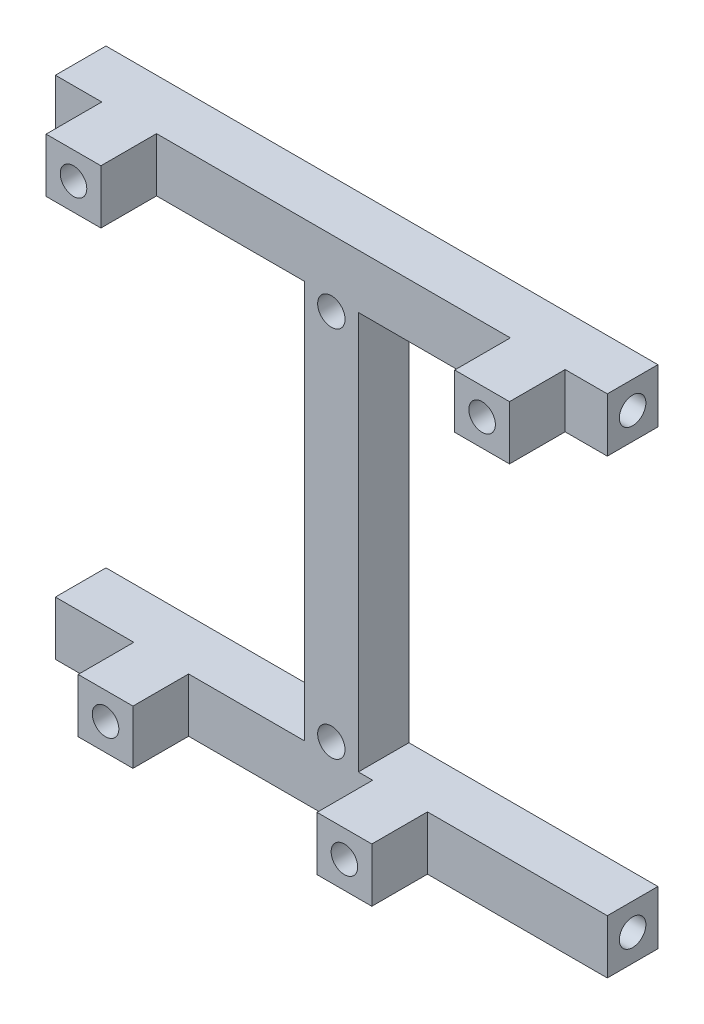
from build123d import *

# Parameters (mm, degrees)
BOSS_EXTRUDE2_DEPTH = 6
SKETCH2_W           = 6.5
SKETCH2_H           = 6.4
BOSS_EXTRUDE3_DEPTH = 6.6
CUT_EXTRUDE1_DEPTH  = 5
CUT_EXTRUDE2_DEPTH  = 51.219845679
CUT_EXTRUDE3_DEPTH  = 15
CUT_EXTRUDE4_START  = -15
CUT_EXTRUDE4_DEPTH  = 15
SKETCH7_W           = 6
SKETCH7_H           = 60
CUT_EXTRUDE5_DEPTH  = 7
SKETCH8_W           = 6
SKETCH8_H           = 60
CUT_EXTRUDE6_DEPTH  = 7


with BuildPart() as part:
    # Sketch1 → Boss-Extrude2 (new body)
    with BuildSketch(Plane.XY):
        Polygon((-39.73, -30), (39.73, -30), (39.73, -23.6), (3.2, -23.6), (3.2, 23.6), (39.73, 23.6), (39.73, 30), (-39.73, 30), (-39.73, 23.6), (-3.2, 23.6), (-3.2, -23.6), (-39.73, -23.6), align=None)
    extrude(amount=BOSS_EXTRUDE2_DEPTH)

    # Sketch2 → Boss-Extrude3 (add)
    with BuildSketch(Plane.XY.offset(6)):
        with Locations((24.48, 26.8)):
            Rectangle(SKETCH2_W, SKETCH2_H)
        with Locations((-23.98, 26.8)):
            Rectangle(SKETCH2_W, SKETCH2_H)
        with Locations((-20.18, -26.8)):
            Rectangle(SKETCH2_W, SKETCH2_H)
        with Locations((8.15, -26.8)):
            Rectangle(SKETCH2_W, SKETCH2_H)
    extrude(amount=BOSS_EXTRUDE3_DEPTH)

    # Sketch3 → Cut-Extrude1 (cut)
    with BuildSketch(Plane.XY.offset(12.6)):
        with BuildLine():
            ThreePointArc((-19.057707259, -25.694973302), (-20.18, -25.225), (-21.302292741, -25.694973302))
            Line((-21.302292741, -25.694973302), (-20.18, -26.8))
            Line((-20.18, -26.8), (-19.057707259, -25.694973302))
        make_face()
        with BuildLine():
            Line((-20.18, -26.8), (-21.302292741, -25.694973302))
            ThreePointArc((-21.302292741, -25.694973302), (-21.755, -26.8), (-21.302292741, -27.905026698))
            Line((-21.302292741, -27.905026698), (-20.18, -26.8))
        make_face()
        with BuildLine():
            Line((-19.057707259, -25.694973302), (-20.18, -26.8))
            Line((-20.18, -26.8), (-19.057707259, -27.905026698))
            ThreePointArc((-19.057707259, -27.905026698), (-18.72256457, -27.397082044), (-18.605, -26.8))
            ThreePointArc((-18.605, -26.8), (-18.72256457, -26.202917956), (-19.057707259, -25.694973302))
        make_face()
        with BuildLine():
            Line((-19.057707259, -27.905026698), (-20.18, -26.8))
            Line((-20.18, -26.8), (-21.302292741, -27.905026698))
            ThreePointArc((-21.302292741, -27.905026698), (-20.18, -28.375), (-19.057707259, -27.905026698))
        make_face()
        with BuildLine():
            ThreePointArc((-19.057707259, -25.694973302), (-20.18, -25.225), (-21.302292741, -25.694973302))
            Line((-21.302292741, -25.694973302), (-20.18, -26.8))
            Line((-20.18, -26.8), (-19.057707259, -25.694973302))
        make_face()
        with BuildLine():
            Line((-20.18, -26.8), (-21.302292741, -25.694973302))
            ThreePointArc((-21.302292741, -25.694973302), (-21.755, -26.8), (-21.302292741, -27.905026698))
            Line((-21.302292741, -27.905026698), (-20.18, -26.8))
        make_face()
        with BuildLine():
            Line((-19.057707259, -25.694973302), (-20.18, -26.8))
            Line((-20.18, -26.8), (-19.057707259, -27.905026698))
            ThreePointArc((-19.057707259, -27.905026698), (-18.72256457, -27.397082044), (-18.605, -26.8))
            ThreePointArc((-18.605, -26.8), (-18.72256457, -26.202917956), (-19.057707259, -25.694973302))
        make_face()
        with BuildLine():
            Line((-19.057707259, -27.905026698), (-20.18, -26.8))
            Line((-20.18, -26.8), (-21.302292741, -27.905026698))
            ThreePointArc((-21.302292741, -27.905026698), (-20.18, -28.375), (-19.057707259, -27.905026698))
        make_face()
        with BuildLine():
            ThreePointArc((-19.057707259, -25.694973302), (-20.18, -25.225), (-21.302292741, -25.694973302))
            Line((-21.302292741, -25.694973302), (-20.18, -26.8))
            Line((-20.18, -26.8), (-19.057707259, -25.694973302))
        make_face()
        with BuildLine():
            Line((-20.18, -26.8), (-21.302292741, -25.694973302))
            ThreePointArc((-21.302292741, -25.694973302), (-21.755, -26.8), (-21.302292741, -27.905026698))
            Line((-21.302292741, -27.905026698), (-20.18, -26.8))
        make_face()
        with BuildLine():
            Line((-19.057707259, -25.694973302), (-20.18, -26.8))
            Line((-20.18, -26.8), (-19.057707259, -27.905026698))
            ThreePointArc((-19.057707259, -27.905026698), (-18.72256457, -27.397082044), (-18.605, -26.8))
            ThreePointArc((-18.605, -26.8), (-18.72256457, -26.202917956), (-19.057707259, -25.694973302))
        make_face()
        with BuildLine():
            Line((-19.057707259, -27.905026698), (-20.18, -26.8))
            Line((-20.18, -26.8), (-21.302292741, -27.905026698))
            ThreePointArc((-21.302292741, -27.905026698), (-20.18, -28.375), (-19.057707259, -27.905026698))
        make_face()
        with BuildLine():
            ThreePointArc((-19.057707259, -25.694973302), (-20.18, -25.225), (-21.302292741, -25.694973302))
            Line((-21.302292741, -25.694973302), (-20.18, -26.8))
            Line((-20.18, -26.8), (-19.057707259, -25.694973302))
        make_face()
        with BuildLine():
            Line((-20.18, -26.8), (-21.302292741, -25.694973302))
            ThreePointArc((-21.302292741, -25.694973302), (-21.755, -26.8), (-21.302292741, -27.905026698))
            Line((-21.302292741, -27.905026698), (-20.18, -26.8))
        make_face()
        with BuildLine():
            Line((-19.057707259, -25.694973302), (-20.18, -26.8))
            Line((-20.18, -26.8), (-19.057707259, -27.905026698))
            ThreePointArc((-19.057707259, -27.905026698), (-18.72256457, -27.397082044), (-18.605, -26.8))
            ThreePointArc((-18.605, -26.8), (-18.72256457, -26.202917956), (-19.057707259, -25.694973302))
        make_face()
        with BuildLine():
            Line((-19.057707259, -27.905026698), (-20.18, -26.8))
            Line((-20.18, -26.8), (-21.302292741, -27.905026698))
            ThreePointArc((-21.302292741, -27.905026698), (-20.18, -28.375), (-19.057707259, -27.905026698))
        make_face()
        with BuildLine():
            ThreePointArc((9.272292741, -25.694973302), (8.15, -25.225), (7.027707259, -25.694973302))
            Line((7.027707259, -25.694973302), (8.15, -26.8))
            Line((8.15, -26.8), (9.272292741, -25.694973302))
        make_face()
        with BuildLine():
            Line((8.15, -26.8), (7.027707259, -25.694973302))
            ThreePointArc((7.027707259, -25.694973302), (6.575, -26.8), (7.027707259, -27.905026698))
            Line((7.027707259, -27.905026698), (8.15, -26.8))
        make_face()
        with BuildLine():
            Line((9.272292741, -25.694973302), (8.15, -26.8))
            Line((8.15, -26.8), (9.272292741, -27.905026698))
            ThreePointArc((9.272292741, -27.905026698), (9.60743543, -27.397082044), (9.725, -26.8))
            ThreePointArc((9.725, -26.8), (9.60743543, -26.202917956), (9.272292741, -25.694973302))
        make_face()
        with BuildLine():
            Line((9.272292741, -27.905026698), (8.15, -26.8))
            Line((8.15, -26.8), (7.027707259, -27.905026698))
            ThreePointArc((7.027707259, -27.905026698), (8.15, -28.375), (9.272292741, -27.905026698))
        make_face()
        with BuildLine():
            ThreePointArc((9.272292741, -25.694973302), (8.15, -25.225), (7.027707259, -25.694973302))
            Line((7.027707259, -25.694973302), (8.15, -26.8))
            Line((8.15, -26.8), (9.272292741, -25.694973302))
        make_face()
        with BuildLine():
            Line((8.15, -26.8), (7.027707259, -25.694973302))
            ThreePointArc((7.027707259, -25.694973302), (6.575, -26.8), (7.027707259, -27.905026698))
            Line((7.027707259, -27.905026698), (8.15, -26.8))
        make_face()
        with BuildLine():
            Line((9.272292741, -25.694973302), (8.15, -26.8))
            Line((8.15, -26.8), (9.272292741, -27.905026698))
            ThreePointArc((9.272292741, -27.905026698), (9.60743543, -27.397082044), (9.725, -26.8))
            ThreePointArc((9.725, -26.8), (9.60743543, -26.202917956), (9.272292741, -25.694973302))
        make_face()
        with BuildLine():
            Line((9.272292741, -27.905026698), (8.15, -26.8))
            Line((8.15, -26.8), (7.027707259, -27.905026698))
            ThreePointArc((7.027707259, -27.905026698), (8.15, -28.375), (9.272292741, -27.905026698))
        make_face()
        with BuildLine():
            ThreePointArc((9.272292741, -25.694973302), (8.15, -25.225), (7.027707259, -25.694973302))
            Line((7.027707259, -25.694973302), (8.15, -26.8))
            Line((8.15, -26.8), (9.272292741, -25.694973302))
        make_face()
        with BuildLine():
            Line((8.15, -26.8), (7.027707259, -25.694973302))
            ThreePointArc((7.027707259, -25.694973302), (6.575, -26.8), (7.027707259, -27.905026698))
            Line((7.027707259, -27.905026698), (8.15, -26.8))
        make_face()
        with BuildLine():
            Line((9.272292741, -25.694973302), (8.15, -26.8))
            Line((8.15, -26.8), (9.272292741, -27.905026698))
            ThreePointArc((9.272292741, -27.905026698), (9.60743543, -27.397082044), (9.725, -26.8))
            ThreePointArc((9.725, -26.8), (9.60743543, -26.202917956), (9.272292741, -25.694973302))
        make_face()
        with BuildLine():
            Line((9.272292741, -27.905026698), (8.15, -26.8))
            Line((8.15, -26.8), (7.027707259, -27.905026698))
            ThreePointArc((7.027707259, -27.905026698), (8.15, -28.375), (9.272292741, -27.905026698))
        make_face()
        with BuildLine():
            ThreePointArc((9.272292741, -25.694973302), (8.15, -25.225), (7.027707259, -25.694973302))
            Line((7.027707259, -25.694973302), (8.15, -26.8))
            Line((8.15, -26.8), (9.272292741, -25.694973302))
        make_face()
        with BuildLine():
            Line((8.15, -26.8), (7.027707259, -25.694973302))
            ThreePointArc((7.027707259, -25.694973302), (6.575, -26.8), (7.027707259, -27.905026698))
            Line((7.027707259, -27.905026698), (8.15, -26.8))
        make_face()
        with BuildLine():
            Line((9.272292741, -25.694973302), (8.15, -26.8))
            Line((8.15, -26.8), (9.272292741, -27.905026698))
            ThreePointArc((9.272292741, -27.905026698), (9.60743543, -27.397082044), (9.725, -26.8))
            ThreePointArc((9.725, -26.8), (9.60743543, -26.202917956), (9.272292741, -25.694973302))
        make_face()
        with BuildLine():
            Line((9.272292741, -27.905026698), (8.15, -26.8))
            Line((8.15, -26.8), (7.027707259, -27.905026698))
            ThreePointArc((7.027707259, -27.905026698), (8.15, -28.375), (9.272292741, -27.905026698))
        make_face()
        with BuildLine():
            ThreePointArc((-22.857707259, 27.905026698), (-23.98, 28.375), (-25.102292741, 27.905026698))
            Line((-25.102292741, 27.905026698), (-23.98, 26.8))
            Line((-23.98, 26.8), (-22.857707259, 27.905026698))
        make_face()
        with BuildLine():
            Line((-23.98, 26.8), (-25.102292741, 27.905026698))
            ThreePointArc((-25.102292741, 27.905026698), (-25.555, 26.8), (-25.102292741, 25.694973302))
            Line((-25.102292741, 25.694973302), (-23.98, 26.8))
        make_face()
        with BuildLine():
            Line((-22.857707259, 27.905026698), (-23.98, 26.8))
            Line((-23.98, 26.8), (-22.857707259, 25.694973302))
            ThreePointArc((-22.857707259, 25.694973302), (-22.52256457, 26.202917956), (-22.405, 26.8))
            ThreePointArc((-22.405, 26.8), (-22.52256457, 27.397082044), (-22.857707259, 27.905026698))
        make_face()
        with BuildLine():
            Line((-22.857707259, 25.694973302), (-23.98, 26.8))
            Line((-23.98, 26.8), (-25.102292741, 25.694973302))
            ThreePointArc((-25.102292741, 25.694973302), (-23.98, 25.225), (-22.857707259, 25.694973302))
        make_face()
        with BuildLine():
            ThreePointArc((-22.857707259, 27.905026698), (-23.98, 28.375), (-25.102292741, 27.905026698))
            Line((-25.102292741, 27.905026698), (-23.98, 26.8))
            Line((-23.98, 26.8), (-22.857707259, 27.905026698))
        make_face()
        with BuildLine():
            Line((-23.98, 26.8), (-25.102292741, 27.905026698))
            ThreePointArc((-25.102292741, 27.905026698), (-25.555, 26.8), (-25.102292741, 25.694973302))
            Line((-25.102292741, 25.694973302), (-23.98, 26.8))
        make_face()
        with BuildLine():
            Line((-22.857707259, 27.905026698), (-23.98, 26.8))
            Line((-23.98, 26.8), (-22.857707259, 25.694973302))
            ThreePointArc((-22.857707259, 25.694973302), (-22.52256457, 26.202917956), (-22.405, 26.8))
            ThreePointArc((-22.405, 26.8), (-22.52256457, 27.397082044), (-22.857707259, 27.905026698))
        make_face()
        with BuildLine():
            Line((-22.857707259, 25.694973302), (-23.98, 26.8))
            Line((-23.98, 26.8), (-25.102292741, 25.694973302))
            ThreePointArc((-25.102292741, 25.694973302), (-23.98, 25.225), (-22.857707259, 25.694973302))
        make_face()
        with BuildLine():
            ThreePointArc((-22.857707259, 27.905026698), (-23.98, 28.375), (-25.102292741, 27.905026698))
            Line((-25.102292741, 27.905026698), (-23.98, 26.8))
            Line((-23.98, 26.8), (-22.857707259, 27.905026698))
        make_face()
        with BuildLine():
            Line((-23.98, 26.8), (-25.102292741, 27.905026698))
            ThreePointArc((-25.102292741, 27.905026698), (-25.555, 26.8), (-25.102292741, 25.694973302))
            Line((-25.102292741, 25.694973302), (-23.98, 26.8))
        make_face()
        with BuildLine():
            Line((-22.857707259, 27.905026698), (-23.98, 26.8))
            Line((-23.98, 26.8), (-22.857707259, 25.694973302))
            ThreePointArc((-22.857707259, 25.694973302), (-22.52256457, 26.202917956), (-22.405, 26.8))
            ThreePointArc((-22.405, 26.8), (-22.52256457, 27.397082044), (-22.857707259, 27.905026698))
        make_face()
        with BuildLine():
            Line((-22.857707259, 25.694973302), (-23.98, 26.8))
            Line((-23.98, 26.8), (-25.102292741, 25.694973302))
            ThreePointArc((-25.102292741, 25.694973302), (-23.98, 25.225), (-22.857707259, 25.694973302))
        make_face()
        with BuildLine():
            ThreePointArc((-22.857707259, 27.905026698), (-23.98, 28.375), (-25.102292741, 27.905026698))
            Line((-25.102292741, 27.905026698), (-23.98, 26.8))
            Line((-23.98, 26.8), (-22.857707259, 27.905026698))
        make_face()
        with BuildLine():
            Line((-23.98, 26.8), (-25.102292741, 27.905026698))
            ThreePointArc((-25.102292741, 27.905026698), (-25.555, 26.8), (-25.102292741, 25.694973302))
            Line((-25.102292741, 25.694973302), (-23.98, 26.8))
        make_face()
        with BuildLine():
            Line((-22.857707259, 27.905026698), (-23.98, 26.8))
            Line((-23.98, 26.8), (-22.857707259, 25.694973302))
            ThreePointArc((-22.857707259, 25.694973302), (-22.52256457, 26.202917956), (-22.405, 26.8))
            ThreePointArc((-22.405, 26.8), (-22.52256457, 27.397082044), (-22.857707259, 27.905026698))
        make_face()
        with BuildLine():
            Line((-22.857707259, 25.694973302), (-23.98, 26.8))
            Line((-23.98, 26.8), (-25.102292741, 25.694973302))
            ThreePointArc((-25.102292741, 25.694973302), (-23.98, 25.225), (-22.857707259, 25.694973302))
        make_face()
        with BuildLine():
            ThreePointArc((23.357707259, 27.905026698), (22.905, 26.8), (23.357707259, 25.694973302))
            Line((23.357707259, 25.694973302), (24.48, 26.8))
            Line((24.48, 26.8), (23.357707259, 27.905026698))
        make_face()
        with BuildLine():
            Line((24.48, 26.8), (23.357707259, 25.694973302))
            ThreePointArc((23.357707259, 25.694973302), (24.48, 25.225), (25.602292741, 25.694973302))
            Line((25.602292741, 25.694973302), (24.48, 26.8))
        make_face()
        with BuildLine():
            Line((23.357707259, 27.905026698), (24.48, 26.8))
            Line((24.48, 26.8), (25.602292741, 27.905026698))
            ThreePointArc((25.602292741, 27.905026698), (24.48, 28.375), (23.357707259, 27.905026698))
        make_face()
        with BuildLine():
            Line((25.602292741, 27.905026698), (24.48, 26.8))
            Line((24.48, 26.8), (25.602292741, 25.694973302))
            ThreePointArc((25.602292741, 25.694973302), (25.93743543, 26.202917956), (26.055, 26.8))
            ThreePointArc((26.055, 26.8), (25.93743543, 27.397082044), (25.602292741, 27.905026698))
        make_face()
        with BuildLine():
            ThreePointArc((23.357707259, 27.905026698), (22.905, 26.8), (23.357707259, 25.694973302))
            Line((23.357707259, 25.694973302), (24.48, 26.8))
            Line((24.48, 26.8), (23.357707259, 27.905026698))
        make_face()
        with BuildLine():
            Line((24.48, 26.8), (23.357707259, 25.694973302))
            ThreePointArc((23.357707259, 25.694973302), (24.48, 25.225), (25.602292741, 25.694973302))
            Line((25.602292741, 25.694973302), (24.48, 26.8))
        make_face()
        with BuildLine():
            Line((23.357707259, 27.905026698), (24.48, 26.8))
            Line((24.48, 26.8), (25.602292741, 27.905026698))
            ThreePointArc((25.602292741, 27.905026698), (24.48, 28.375), (23.357707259, 27.905026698))
        make_face()
        with BuildLine():
            Line((25.602292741, 27.905026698), (24.48, 26.8))
            Line((24.48, 26.8), (25.602292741, 25.694973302))
            ThreePointArc((25.602292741, 25.694973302), (25.93743543, 26.202917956), (26.055, 26.8))
            ThreePointArc((26.055, 26.8), (25.93743543, 27.397082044), (25.602292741, 27.905026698))
        make_face()
        with BuildLine():
            ThreePointArc((23.357707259, 27.905026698), (22.905, 26.8), (23.357707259, 25.694973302))
            Line((23.357707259, 25.694973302), (24.48, 26.8))
            Line((24.48, 26.8), (23.357707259, 27.905026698))
        make_face()
        with BuildLine():
            Line((24.48, 26.8), (23.357707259, 25.694973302))
            ThreePointArc((23.357707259, 25.694973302), (24.48, 25.225), (25.602292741, 25.694973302))
            Line((25.602292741, 25.694973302), (24.48, 26.8))
        make_face()
        with BuildLine():
            Line((23.357707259, 27.905026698), (24.48, 26.8))
            Line((24.48, 26.8), (25.602292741, 27.905026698))
            ThreePointArc((25.602292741, 27.905026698), (24.48, 28.375), (23.357707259, 27.905026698))
        make_face()
        with BuildLine():
            Line((25.602292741, 27.905026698), (24.48, 26.8))
            Line((24.48, 26.8), (25.602292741, 25.694973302))
            ThreePointArc((25.602292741, 25.694973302), (25.93743543, 26.202917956), (26.055, 26.8))
            ThreePointArc((26.055, 26.8), (25.93743543, 27.397082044), (25.602292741, 27.905026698))
        make_face()
        with BuildLine():
            ThreePointArc((23.357707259, 27.905026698), (22.905, 26.8), (23.357707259, 25.694973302))
            Line((23.357707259, 25.694973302), (24.48, 26.8))
            Line((24.48, 26.8), (23.357707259, 27.905026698))
        make_face()
        with BuildLine():
            Line((24.48, 26.8), (23.357707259, 25.694973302))
            ThreePointArc((23.357707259, 25.694973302), (24.48, 25.225), (25.602292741, 25.694973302))
            Line((25.602292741, 25.694973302), (24.48, 26.8))
        make_face()
        with BuildLine():
            Line((23.357707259, 27.905026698), (24.48, 26.8))
            Line((24.48, 26.8), (25.602292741, 27.905026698))
            ThreePointArc((25.602292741, 27.905026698), (24.48, 28.375), (23.357707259, 27.905026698))
        make_face()
        with BuildLine():
            Line((25.602292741, 27.905026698), (24.48, 26.8))
            Line((24.48, 26.8), (25.602292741, 25.694973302))
            ThreePointArc((25.602292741, 25.694973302), (25.93743543, 26.202917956), (26.055, 26.8))
            ThreePointArc((26.055, 26.8), (25.93743543, 27.397082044), (25.602292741, 27.905026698))
        make_face()
    extrude(amount=-CUT_EXTRUDE1_DEPTH, mode=Mode.SUBTRACT)

    # Sketch4 → Cut-Extrude2 (cut, through all)
    with BuildSketch(Plane.XY.offset(6)):
        with BuildLine():
            ThreePointArc((1.625, 22.1), (0, 23.725), (-1.625, 22.1))
            Line((-1.625, 22.1), (1.625, 22.1))
        make_face()
        with BuildLine():
            Line((1.625, 22.1), (-1.625, 22.1))
            ThreePointArc((-1.625, 22.1), (0, 20.475), (1.625, 22.1))
        make_face()
        with BuildLine():
            ThreePointArc((1.625, 22.1), (0, 23.725), (-1.625, 22.1))
            Line((-1.625, 22.1), (1.625, 22.1))
        make_face()
        with BuildLine():
            Line((1.625, 22.1), (-1.625, 22.1))
            ThreePointArc((-1.625, 22.1), (0, 20.475), (1.625, 22.1))
        make_face()
        with BuildLine():
            ThreePointArc((1.625, -22.1), (0, -20.475), (-1.625, -22.1))
            Line((-1.625, -22.1), (1.625, -22.1))
        make_face()
        with BuildLine():
            Line((1.625, -22.1), (-1.625, -22.1))
            ThreePointArc((-1.625, -22.1), (0, -23.725), (1.625, -22.1))
        make_face()
        with BuildLine():
            ThreePointArc((1.625, -22.1), (0, -20.475), (-1.625, -22.1))
            Line((-1.625, -22.1), (1.625, -22.1))
        make_face()
        with BuildLine():
            Line((1.625, -22.1), (-1.625, -22.1))
            ThreePointArc((-1.625, -22.1), (0, -23.725), (1.625, -22.1))
        make_face()
    extrude(amount=-CUT_EXTRUDE2_DEPTH, mode=Mode.SUBTRACT)

    # Sketch5 → Cut-Extrude3 (cut)
    with BuildSketch(Plane(origin=(39.73, 0, 0), x_dir=(0, 0, -1), z_dir=(1, 0, 0))):
        with BuildLine():
            ThreePointArc((-1.922792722, -25.650978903), (-4.149021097, -25.722792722), (-4.077207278, -27.949021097))
            Line((-4.077207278, -27.949021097), (-1.922792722, -25.650978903))
        make_face()
        with BuildLine():
            Line((-1.922792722, -25.650978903), (-4.077207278, -27.949021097))
            ThreePointArc((-4.077207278, -27.949021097), (-2.373891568, -28.245203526), (-1.425, -26.8))
            ThreePointArc((-1.425, -26.8), (-1.554796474, -26.173891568), (-1.922792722, -25.650978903))
        make_face()
        with BuildLine():
            ThreePointArc((-1.922792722, -25.650978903), (-4.149021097, -25.722792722), (-4.077207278, -27.949021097))
            Line((-4.077207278, -27.949021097), (-1.922792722, -25.650978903))
        make_face()
        with BuildLine():
            Line((-1.922792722, -25.650978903), (-4.077207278, -27.949021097))
            ThreePointArc((-4.077207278, -27.949021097), (-2.373891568, -28.245203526), (-1.425, -26.8))
            ThreePointArc((-1.425, -26.8), (-1.554796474, -26.173891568), (-1.922792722, -25.650978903))
        make_face()
        with BuildLine():
            ThreePointArc((-1.922792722, 27.949021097), (-4.149021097, 27.877207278), (-4.077207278, 25.650978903))
            Line((-4.077207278, 25.650978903), (-1.922792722, 27.949021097))
        make_face()
        with BuildLine():
            Line((-1.922792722, 27.949021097), (-4.077207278, 25.650978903))
            ThreePointArc((-4.077207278, 25.650978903), (-2.373891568, 25.354796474), (-1.425, 26.8))
            ThreePointArc((-1.425, 26.8), (-1.554796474, 27.426108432), (-1.922792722, 27.949021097))
        make_face()
        with BuildLine():
            ThreePointArc((-1.922792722, 27.949021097), (-4.149021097, 27.877207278), (-4.077207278, 25.650978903))
            Line((-4.077207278, 25.650978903), (-1.922792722, 27.949021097))
        make_face()
        with BuildLine():
            Line((-1.922792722, 27.949021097), (-4.077207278, 25.650978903))
            ThreePointArc((-4.077207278, 25.650978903), (-2.373891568, 25.354796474), (-1.425, 26.8))
            ThreePointArc((-1.425, 26.8), (-1.554796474, 27.426108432), (-1.922792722, 27.949021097))
        make_face()
    extrude(amount=-CUT_EXTRUDE3_DEPTH, mode=Mode.SUBTRACT)

    # Sketch6 → Cut-Extrude4 (cut)
    with BuildSketch(Plane.ZY.offset(39.73).offset(CUT_EXTRUDE4_START)):
        with BuildLine():
            ThreePointArc((4.575, 26.8), (3.626108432, 28.245203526), (1.922792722, 27.949021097))
            Line((1.922792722, 27.949021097), (4.077207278, 25.650978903))
            ThreePointArc((4.077207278, 25.650978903), (4.445203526, 26.173891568), (4.575, 26.8))
        make_face()
        with BuildLine():
            Line((4.077207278, 25.650978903), (1.922792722, 27.949021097))
            ThreePointArc((1.922792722, 27.949021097), (1.850978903, 25.722792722), (4.077207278, 25.650978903))
        make_face()
        with BuildLine():
            ThreePointArc((4.575, 26.8), (3.626108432, 28.245203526), (1.922792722, 27.949021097))
            Line((1.922792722, 27.949021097), (4.077207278, 25.650978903))
            ThreePointArc((4.077207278, 25.650978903), (4.445203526, 26.173891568), (4.575, 26.8))
        make_face()
        with BuildLine():
            Line((4.077207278, 25.650978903), (1.922792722, 27.949021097))
            ThreePointArc((1.922792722, 27.949021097), (1.850978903, 25.722792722), (4.077207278, 25.650978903))
        make_face()
        with BuildLine():
            ThreePointArc((4.575, -26.8), (3.626108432, -25.354796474), (1.922792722, -25.650978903))
            Line((1.922792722, -25.650978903), (4.077207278, -27.949021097))
            ThreePointArc((4.077207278, -27.949021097), (4.445203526, -27.426108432), (4.575, -26.8))
        make_face()
        with BuildLine():
            Line((4.077207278, -27.949021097), (1.922792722, -25.650978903))
            ThreePointArc((1.922792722, -25.650978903), (1.850978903, -27.877207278), (4.077207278, -27.949021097))
        make_face()
        with BuildLine():
            ThreePointArc((4.575, -26.8), (3.626108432, -25.354796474), (1.922792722, -25.650978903))
            Line((1.922792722, -25.650978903), (4.077207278, -27.949021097))
            ThreePointArc((4.077207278, -27.949021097), (4.445203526, -27.426108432), (4.575, -26.8))
        make_face()
        with BuildLine():
            Line((4.077207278, -27.949021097), (1.922792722, -25.650978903))
            ThreePointArc((1.922792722, -25.650978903), (1.850978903, -27.877207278), (4.077207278, -27.949021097))
        make_face()
    extrude(amount=CUT_EXTRUDE4_DEPTH, mode=Mode.SUBTRACT)

    # Sketch7 → Cut-Extrude5 (cut)
    with BuildSketch(Plane(origin=(39.73, 0, 0), x_dir=(0, 0, -1), z_dir=(1, 0, 0))):
        with Locations((-3, 0)):
            Rectangle(SKETCH7_W, SKETCH7_H)
    extrude(amount=-CUT_EXTRUDE5_DEPTH, mode=Mode.SUBTRACT)

    # Sketch8 → Cut-Extrude6 (cut)
    with BuildSketch(Plane.ZY.offset(39.73)):
        with Locations((3, 0)):
            Rectangle(SKETCH8_W, SKETCH8_H)
    extrude(amount=-CUT_EXTRUDE6_DEPTH, mode=Mode.SUBTRACT)


solid = part.part
